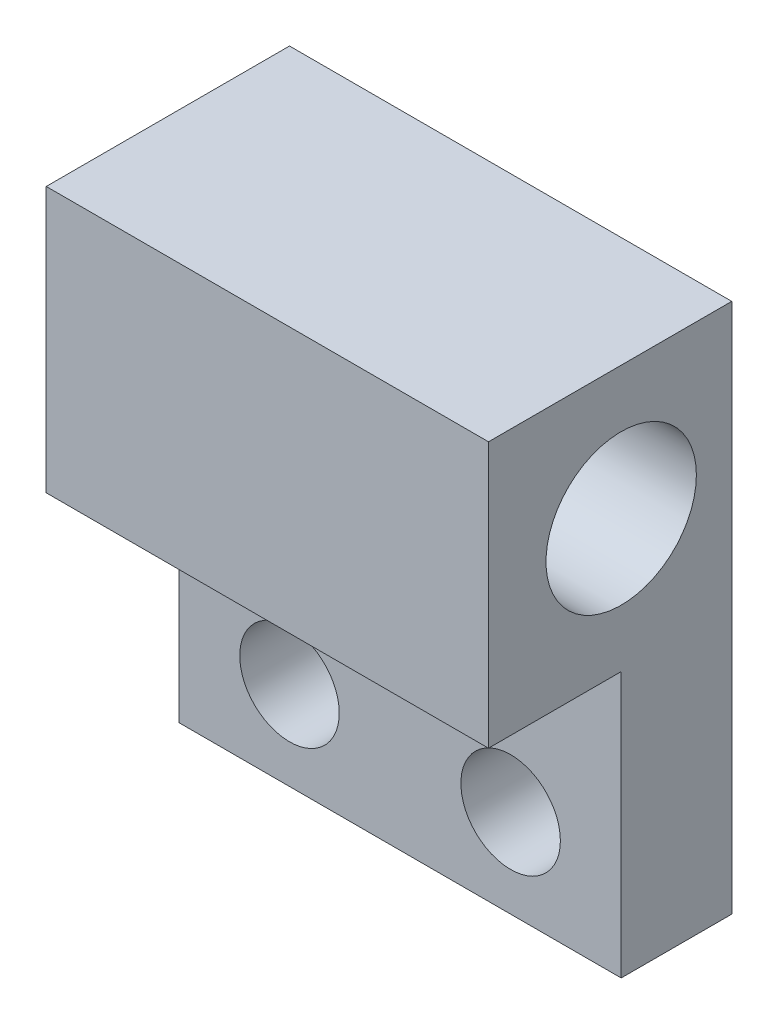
ISO-10303-21;
HEADER;
FILE_DESCRIPTION(('STEP AP214'),'2;1');
FILE_NAME('part.step','',(''),(''),'','','');
FILE_SCHEMA(('AUTOMOTIVE_DESIGN { 1 0 10303 214 1 1 1 1 }'));
ENDSEC;
DATA;
#1=APPLICATION_CONTEXT('core data for automotive mechanical design processes');
#2=APPLICATION_PROTOCOL_DEFINITION('international standard','automotive_design',2000,#1);
#3=PRODUCT_CONTEXT('',#1,'mechanical');
#4=PRODUCT('Part','Part','',(#3));
#5=PRODUCT_RELATED_PRODUCT_CATEGORY('part','',(#4));
#6=PRODUCT_DEFINITION_FORMATION('','',#4);
#7=PRODUCT_DEFINITION_CONTEXT('part definition',#1,'design');
#8=PRODUCT_DEFINITION('design','',#6,#7);
#9=PRODUCT_DEFINITION_SHAPE('','',#8);
#10=(LENGTH_UNIT() NAMED_UNIT(*) SI_UNIT(.MILLI.,.METRE.));
#11=(NAMED_UNIT(*) PLANE_ANGLE_UNIT() SI_UNIT($,.RADIAN.));
#12=(NAMED_UNIT(*) SI_UNIT($,.STERADIAN.) SOLID_ANGLE_UNIT());
#13=UNCERTAINTY_MEASURE_WITH_UNIT(LENGTH_MEASURE(1.E-05),#10,'distance_accuracy_value','');
#14=(GEOMETRIC_REPRESENTATION_CONTEXT(3) GLOBAL_UNCERTAINTY_ASSIGNED_CONTEXT((#13)) GLOBAL_UNIT_ASSIGNED_CONTEXT((#10,
#11,#12)) REPRESENTATION_CONTEXT('',''));
#15=CARTESIAN_POINT('',(0.,0.,0.));
#16=DIRECTION('',(0.,0.,1.));
#17=DIRECTION('',(1.,0.,0.));
#18=AXIS2_PLACEMENT_3D('',#15,#16,#17);
#19=CARTESIAN_POINT('',(-10.,-6.,11.));
#20=DIRECTION('',(0.,1.,0.));
#21=DIRECTION('',(0.,0.,1.));
#22=AXIS2_PLACEMENT_3D('',#19,#20,#21);
#23=PLANE('',#22);
#24=DIRECTION('',(-1.,0.,0.));
#25=VECTOR('',#24,1.);
#26=CARTESIAN_POINT('',(-10.,-6.,5.));
#27=LINE('',#26,#25);
#28=CARTESIAN_POINT('',(10.,-6.,5.));
#29=VERTEX_POINT('',#28);
#30=CARTESIAN_POINT('',(-10.,-6.,5.));
#31=VERTEX_POINT('',#30);
#32=EDGE_CURVE('E56',#29,#31,#27,.T.);
#33=ORIENTED_EDGE('',*,*,#32,.F.);
#34=DIRECTION('',(0.,0.,-1.));
#35=VECTOR('',#34,1.);
#36=CARTESIAN_POINT('',(10.,-6.,11.));
#37=LINE('',#36,#35);
#38=CARTESIAN_POINT('',(10.,-6.,11.));
#39=VERTEX_POINT('',#38);
#40=EDGE_CURVE('E141',#39,#29,#37,.T.);
#41=ORIENTED_EDGE('',*,*,#40,.F.);
#42=DIRECTION('',(1.,0.,0.));
#43=VECTOR('',#42,1.);
#44=CARTESIAN_POINT('',(-10.,-6.,11.));
#45=LINE('',#44,#43);
#46=CARTESIAN_POINT('',(-10.,-6.,11.));
#47=VERTEX_POINT('',#46);
#48=EDGE_CURVE('E65',#47,#39,#45,.T.);
#49=ORIENTED_EDGE('',*,*,#48,.F.);
#50=DIRECTION('',(0.,0.,-1.));
#51=VECTOR('',#50,1.);
#52=CARTESIAN_POINT('',(-10.,-6.,11.));
#53=LINE('',#52,#51);
#54=EDGE_CURVE('E145',#47,#31,#53,.T.);
#55=ORIENTED_EDGE('',*,*,#54,.T.);
#56=EDGE_LOOP('',(#33,#41,#49,#55));
#57=FACE_BOUND('',#56,.T.);
#58=ADVANCED_FACE('F41',(#57),#23,.F.);
#59=CARTESIAN_POINT('',(10.,6.,11.));
#60=DIRECTION('',(-1.,0.,0.));
#61=DIRECTION('',(0.,0.,1.));
#62=AXIS2_PLACEMENT_3D('',#59,#60,#61);
#63=PLANE('',#62);
#64=CARTESIAN_POINT('',(10.,0.,5.));
#65=DIRECTION('',(1.,0.,0.));
#66=DIRECTION('',(0.,0.,-1.));
#67=AXIS2_PLACEMENT_3D('',#64,#65,#66);
#68=CIRCLE('',#67,3.4);
#69=CARTESIAN_POINT('',(10.,0.,1.6));
#70=VERTEX_POINT('',#69);
#71=EDGE_CURVE('E197',#70,#70,#68,.T.);
#72=ORIENTED_EDGE('',*,*,#71,.F.);
#73=EDGE_LOOP('',(#72));
#74=FACE_BOUND('',#73,.T.);
#75=DIRECTION('',(0.,1.,0.));
#76=VECTOR('',#75,1.);
#77=CARTESIAN_POINT('',(10.,6.,0.));
#78=LINE('',#77,#76);
#79=CARTESIAN_POINT('',(10.,-18.,0.));
#80=VERTEX_POINT('',#79);
#81=CARTESIAN_POINT('',(10.,6.,0.));
#82=VERTEX_POINT('',#81);
#83=EDGE_CURVE('E114',#80,#82,#78,.T.);
#84=ORIENTED_EDGE('',*,*,#83,.T.);
#85=DIRECTION('',(0.,0.,-1.));
#86=VECTOR('',#85,1.);
#87=CARTESIAN_POINT('',(10.,6.,11.));
#88=LINE('',#87,#86);
#89=CARTESIAN_POINT('',(10.,6.,11.));
#90=VERTEX_POINT('',#89);
#91=EDGE_CURVE('E11',#90,#82,#88,.T.);
#92=ORIENTED_EDGE('',*,*,#91,.F.);
#93=DIRECTION('',(0.,1.,0.));
#94=VECTOR('',#93,1.);
#95=CARTESIAN_POINT('',(10.,6.,11.));
#96=LINE('',#95,#94);
#97=EDGE_CURVE('E108',#39,#90,#96,.T.);
#98=ORIENTED_EDGE('',*,*,#97,.F.);
#99=ORIENTED_EDGE('',*,*,#40,.T.);
#100=DIRECTION('',(0.,1.,0.));
#101=VECTOR('',#100,1.);
#102=CARTESIAN_POINT('',(10.,-18.,5.));
#103=LINE('',#102,#101);
#104=CARTESIAN_POINT('',(10.,-18.,5.));
#105=VERTEX_POINT('',#104);
#106=EDGE_CURVE('E133',#105,#29,#103,.T.);
#107=ORIENTED_EDGE('',*,*,#106,.F.);
#108=DIRECTION('',(0.,0.,1.));
#109=VECTOR('',#108,1.);
#110=CARTESIAN_POINT('',(10.,-18.,0.));
#111=LINE('',#110,#109);
#112=EDGE_CURVE('E117',#80,#105,#111,.T.);
#113=ORIENTED_EDGE('',*,*,#112,.F.);
#114=EDGE_LOOP('',(#84,#92,#98,#99,#107,#113));
#115=FACE_BOUND('',#114,.T.);
#116=ADVANCED_FACE('F43',(#74,#115),#63,.F.);
#117=CARTESIAN_POINT('',(-10.,6.,11.));
#118=DIRECTION('',(0.,-1.,0.));
#119=DIRECTION('',(0.,0.,-1.));
#120=AXIS2_PLACEMENT_3D('',#117,#118,#119);
#121=PLANE('',#120);
#122=DIRECTION('',(-1.,0.,0.));
#123=VECTOR('',#122,1.);
#124=CARTESIAN_POINT('',(-10.,6.,0.));
#125=LINE('',#124,#123);
#126=CARTESIAN_POINT('',(-10.,6.,0.));
#127=VERTEX_POINT('',#126);
#128=EDGE_CURVE('E78',#82,#127,#125,.T.);
#129=ORIENTED_EDGE('',*,*,#128,.T.);
#130=DIRECTION('',(0.,0.,-1.));
#131=VECTOR('',#130,1.);
#132=CARTESIAN_POINT('',(-10.,6.,11.));
#133=LINE('',#132,#131);
#134=CARTESIAN_POINT('',(-10.,6.,11.));
#135=VERTEX_POINT('',#134);
#136=EDGE_CURVE('E49',#135,#127,#133,.T.);
#137=ORIENTED_EDGE('',*,*,#136,.F.);
#138=DIRECTION('',(-1.,0.,0.));
#139=VECTOR('',#138,1.);
#140=CARTESIAN_POINT('',(-10.,6.,11.));
#141=LINE('',#140,#139);
#142=EDGE_CURVE('E83',#90,#135,#141,.T.);
#143=ORIENTED_EDGE('',*,*,#142,.F.);
#144=ORIENTED_EDGE('',*,*,#91,.T.);
#145=EDGE_LOOP('',(#129,#137,#143,#144));
#146=FACE_BOUND('',#145,.T.);
#147=ADVANCED_FACE('F154',(#146),#121,.F.);
#148=CARTESIAN_POINT('',(-10.,6.,11.));
#149=DIRECTION('',(1.,0.,0.));
#150=DIRECTION('',(0.,1.,0.));
#151=AXIS2_PLACEMENT_3D('',#148,#149,#150);
#152=PLANE('',#151);
#153=CARTESIAN_POINT('',(-10.,0.,5.));
#154=DIRECTION('',(1.,0.,0.));
#155=DIRECTION('',(0.,0.,-1.));
#156=AXIS2_PLACEMENT_3D('',#153,#154,#155);
#157=CIRCLE('',#156,3.4);
#158=CARTESIAN_POINT('',(-10.,0.,1.6));
#159=VERTEX_POINT('',#158);
#160=EDGE_CURVE('E194',#159,#159,#157,.T.);
#161=ORIENTED_EDGE('',*,*,#160,.T.);
#162=EDGE_LOOP('',(#161));
#163=FACE_BOUND('',#162,.T.);
#164=DIRECTION('',(0.,-1.,0.));
#165=VECTOR('',#164,1.);
#166=CARTESIAN_POINT('',(-10.,6.,0.));
#167=LINE('',#166,#165);
#168=CARTESIAN_POINT('',(-10.,-18.,0.));
#169=VERTEX_POINT('',#168);
#170=EDGE_CURVE('E100',#127,#169,#167,.T.);
#171=ORIENTED_EDGE('',*,*,#170,.T.);
#172=DIRECTION('',(0.,0.,-1.));
#173=VECTOR('',#172,1.);
#174=CARTESIAN_POINT('',(-10.,-18.,0.));
#175=LINE('',#174,#173);
#176=CARTESIAN_POINT('',(-10.,-18.,5.));
#177=VERTEX_POINT('',#176);
#178=EDGE_CURVE('E105',#177,#169,#175,.T.);
#179=ORIENTED_EDGE('',*,*,#178,.F.);
#180=DIRECTION('',(0.,1.,0.));
#181=VECTOR('',#180,1.);
#182=CARTESIAN_POINT('',(-10.,-18.,5.));
#183=LINE('',#182,#181);
#184=EDGE_CURVE('E130',#177,#31,#183,.T.);
#185=ORIENTED_EDGE('',*,*,#184,.T.);
#186=ORIENTED_EDGE('',*,*,#54,.F.);
#187=DIRECTION('',(0.,-1.,0.));
#188=VECTOR('',#187,1.);
#189=CARTESIAN_POINT('',(-10.,6.,11.));
#190=LINE('',#189,#188);
#191=EDGE_CURVE('E138',#135,#47,#190,.T.);
#192=ORIENTED_EDGE('',*,*,#191,.F.);
#193=ORIENTED_EDGE('',*,*,#136,.T.);
#194=EDGE_LOOP('',(#171,#179,#185,#186,#192,#193));
#195=FACE_BOUND('',#194,.T.);
#196=ADVANCED_FACE('F102',(#163,#195),#152,.F.);
#197=CARTESIAN_POINT('',(0.,0.,11.));
#198=DIRECTION('',(0.,0.,1.));
#199=DIRECTION('',(1.,0.,0.));
#200=AXIS2_PLACEMENT_3D('',#197,#198,#199);
#201=PLANE('',#200);
#202=ORIENTED_EDGE('',*,*,#97,.T.);
#203=ORIENTED_EDGE('',*,*,#142,.T.);
#204=ORIENTED_EDGE('',*,*,#191,.T.);
#205=ORIENTED_EDGE('',*,*,#48,.T.);
#206=EDGE_LOOP('',(#202,#203,#204,#205));
#207=FACE_BOUND('',#206,.T.);
#208=ADVANCED_FACE('F153',(#207),#201,.T.);
#209=CARTESIAN_POINT('',(0.,0.,0.));
#210=DIRECTION('',(0.,0.,1.));
#211=DIRECTION('',(1.,0.,0.));
#212=AXIS2_PLACEMENT_3D('',#209,#210,#211);
#213=PLANE('',#212);
#214=CARTESIAN_POINT('',(-5.,-14.,0.));
#215=DIRECTION('',(0.,0.,1.));
#216=DIRECTION('',(1.,0.,0.));
#217=AXIS2_PLACEMENT_3D('',#214,#215,#216);
#218=CIRCLE('',#217,2.25);
#219=CARTESIAN_POINT('',(-2.75,-14.,0.));
#220=VERTEX_POINT('',#219);
#221=EDGE_CURVE('E204',#220,#220,#218,.T.);
#222=ORIENTED_EDGE('',*,*,#221,.T.);
#223=EDGE_LOOP('',(#222));
#224=FACE_BOUND('',#223,.T.);
#225=CARTESIAN_POINT('',(5.,-14.,0.));
#226=DIRECTION('',(0.,0.,1.));
#227=DIRECTION('',(1.,0.,0.));
#228=AXIS2_PLACEMENT_3D('',#225,#226,#227);
#229=CIRCLE('',#228,2.25);
#230=CARTESIAN_POINT('',(7.25,-14.,0.));
#231=VERTEX_POINT('',#230);
#232=EDGE_CURVE('E124',#231,#231,#229,.T.);
#233=ORIENTED_EDGE('',*,*,#232,.T.);
#234=EDGE_LOOP('',(#233));
#235=FACE_BOUND('',#234,.T.);
#236=ORIENTED_EDGE('',*,*,#83,.F.);
#237=DIRECTION('',(1.,0.,0.));
#238=VECTOR('',#237,1.);
#239=CARTESIAN_POINT('',(-10.,-18.,0.));
#240=LINE('',#239,#238);
#241=EDGE_CURVE('E111',#169,#80,#240,.T.);
#242=ORIENTED_EDGE('',*,*,#241,.F.);
#243=ORIENTED_EDGE('',*,*,#170,.F.);
#244=ORIENTED_EDGE('',*,*,#128,.F.);
#245=EDGE_LOOP('',(#236,#242,#243,#244));
#246=FACE_BOUND('',#245,.T.);
#247=ADVANCED_FACE('F112',(#224,#235,#246),#213,.F.);
#248=CARTESIAN_POINT('',(-10.,-18.,5.));
#249=DIRECTION('',(0.,0.,-1.));
#250=DIRECTION('',(-1.,0.,0.));
#251=AXIS2_PLACEMENT_3D('',#248,#249,#250);
#252=PLANE('',#251);
#253=CARTESIAN_POINT('',(-5.,-14.,5.));
#254=DIRECTION('',(0.,0.,1.));
#255=DIRECTION('',(1.,0.,0.));
#256=AXIS2_PLACEMENT_3D('',#253,#254,#255);
#257=CIRCLE('',#256,2.25);
#258=CARTESIAN_POINT('',(-2.75,-14.,5.));
#259=VERTEX_POINT('',#258);
#260=EDGE_CURVE('E199',#259,#259,#257,.T.);
#261=ORIENTED_EDGE('',*,*,#260,.F.);
#262=EDGE_LOOP('',(#261));
#263=FACE_BOUND('',#262,.T.);
#264=CARTESIAN_POINT('',(5.,-14.,5.));
#265=DIRECTION('',(0.,0.,1.));
#266=DIRECTION('',(1.,0.,0.));
#267=AXIS2_PLACEMENT_3D('',#264,#265,#266);
#268=CIRCLE('',#267,2.25);
#269=CARTESIAN_POINT('',(7.25,-14.,5.));
#270=VERTEX_POINT('',#269);
#271=EDGE_CURVE('E206',#270,#270,#268,.T.);
#272=ORIENTED_EDGE('',*,*,#271,.F.);
#273=EDGE_LOOP('',(#272));
#274=FACE_BOUND('',#273,.T.);
#275=ORIENTED_EDGE('',*,*,#32,.T.);
#276=ORIENTED_EDGE('',*,*,#184,.F.);
#277=DIRECTION('',(-1.,0.,0.));
#278=VECTOR('',#277,1.);
#279=CARTESIAN_POINT('',(-10.,-18.,5.));
#280=LINE('',#279,#278);
#281=EDGE_CURVE('E121',#105,#177,#280,.T.);
#282=ORIENTED_EDGE('',*,*,#281,.F.);
#283=ORIENTED_EDGE('',*,*,#106,.T.);
#284=EDGE_LOOP('',(#275,#276,#282,#283));
#285=FACE_BOUND('',#284,.T.);
#286=ADVANCED_FACE('F148',(#263,#274,#285),#252,.F.);
#287=CARTESIAN_POINT('',(0.,-18.,0.));
#288=DIRECTION('',(0.,1.,0.));
#289=DIRECTION('',(0.,0.,1.));
#290=AXIS2_PLACEMENT_3D('',#287,#288,#289);
#291=PLANE('',#290);
#292=ORIENTED_EDGE('',*,*,#178,.T.);
#293=ORIENTED_EDGE('',*,*,#241,.T.);
#294=ORIENTED_EDGE('',*,*,#112,.T.);
#295=ORIENTED_EDGE('',*,*,#281,.T.);
#296=EDGE_LOOP('',(#292,#293,#294,#295));
#297=FACE_BOUND('',#296,.T.);
#298=ADVANCED_FACE('F119',(#297),#291,.F.);
#299=CARTESIAN_POINT('',(5.,-14.,5.));
#300=DIRECTION('',(0.,0.,1.));
#301=DIRECTION('',(1.,0.,0.));
#302=AXIS2_PLACEMENT_3D('',#299,#300,#301);
#303=CYLINDRICAL_SURFACE('',#302,2.25);
#304=ORIENTED_EDGE('',*,*,#232,.F.);
#305=EDGE_LOOP('',(#304));
#306=FACE_BOUND('',#305,.T.);
#307=ORIENTED_EDGE('',*,*,#271,.T.);
#308=EDGE_LOOP('',(#307));
#309=FACE_BOUND('',#308,.T.);
#310=ADVANCED_FACE('F178',(#306,#309),#303,.F.);
#311=CARTESIAN_POINT('',(-5.,-14.,5.));
#312=DIRECTION('',(0.,0.,1.));
#313=DIRECTION('',(1.,0.,0.));
#314=AXIS2_PLACEMENT_3D('',#311,#312,#313);
#315=CYLINDRICAL_SURFACE('',#314,2.25);
#316=ORIENTED_EDGE('',*,*,#221,.F.);
#317=EDGE_LOOP('',(#316));
#318=FACE_BOUND('',#317,.T.);
#319=ORIENTED_EDGE('',*,*,#260,.T.);
#320=EDGE_LOOP('',(#319));
#321=FACE_BOUND('',#320,.T.);
#322=ADVANCED_FACE('F181',(#318,#321),#315,.F.);
#323=CARTESIAN_POINT('',(10.,0.,5.));
#324=DIRECTION('',(1.,0.,0.));
#325=DIRECTION('',(0.,0.,-1.));
#326=AXIS2_PLACEMENT_3D('',#323,#324,#325);
#327=CYLINDRICAL_SURFACE('',#326,3.4);
#328=ORIENTED_EDGE('',*,*,#160,.F.);
#329=EDGE_LOOP('',(#328));
#330=FACE_BOUND('',#329,.T.);
#331=ORIENTED_EDGE('',*,*,#71,.T.);
#332=EDGE_LOOP('',(#331));
#333=FACE_BOUND('',#332,.T.);
#334=ADVANCED_FACE('F185',(#330,#333),#327,.F.);
#335=CLOSED_SHELL('',(#58,#116,#147,#196,#208,#247,#286,#298,#310,#322,#334));
#336=MANIFOLD_SOLID_BREP('B2',#335);
#337=ADVANCED_BREP_SHAPE_REPRESENTATION('',(#18,#336),#14);
#338=SHAPE_DEFINITION_REPRESENTATION(#9,#337);
ENDSEC;
END-ISO-10303-21;
